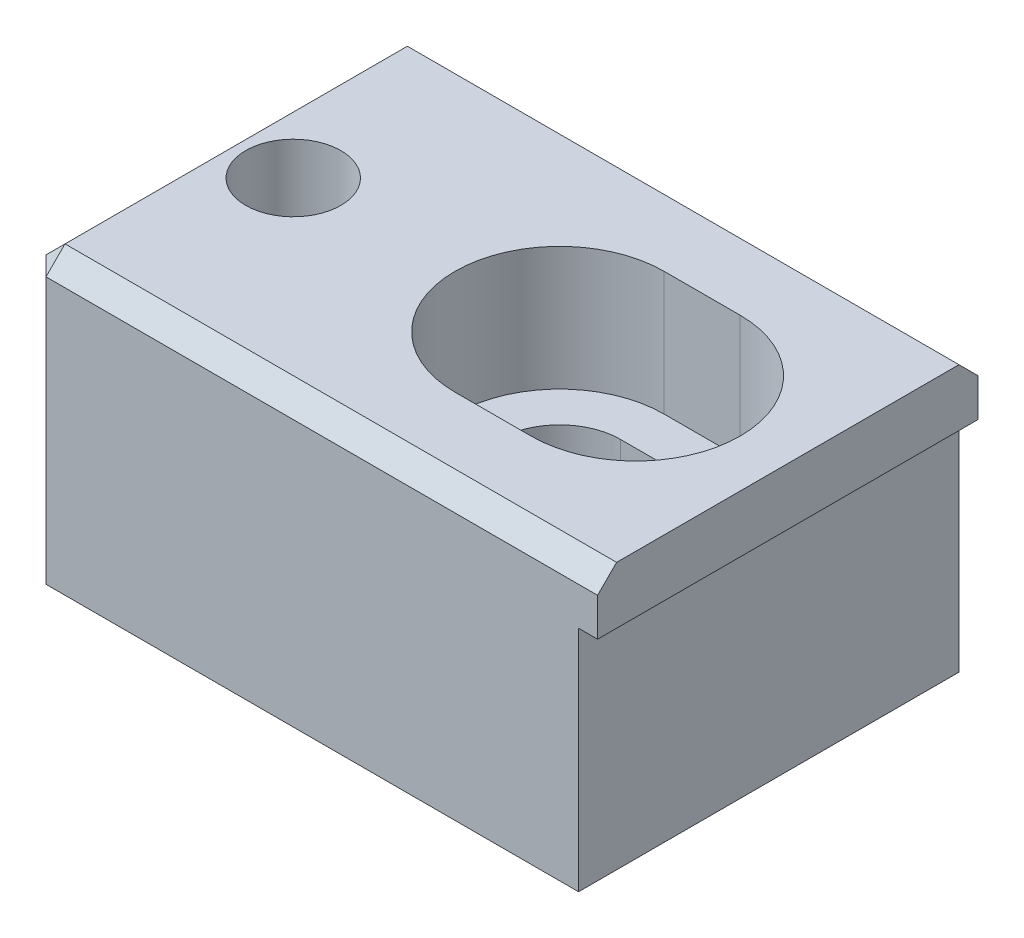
from build123d import *

# Parameters (mm, degrees)
BOSS_EXTRU_1_DEPTH      = 10
CHANFREIN1_SIZE         = 1
TROU_TARAUD_M61_D       = 5
ENL_V_MAT_EXTRU_1_DEPTH = 6.5
ENL_V_MAT_EXTRU_2_DEPTH = 31.561577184


with BuildPart() as part:
    # Esquisse1 → Boss.-Extru.1 (new, symmetric)
    with BuildSketch(Plane.XY):
        Polygon((-27.6, 25), (2.4, 25), (2.4, 22), (1.4, 22), (1.4, 10), (-27.6, 10), align=None)
    extrude(amount=BOSS_EXTRU_1_DEPTH, both=True)

    # Chanfrein1
    chanfrein1_edges = [part.edges().sort_by_distance(p)[0] for p in [
        (-27.6, 25, 0),
        (-12.6, 25, 10),
        (-27.6, 17.5, 10),
        (-12.6, 25, -10),
        (-27.6, 17.5, -10),
    ]]
    chamfer(chanfrein1_edges, length=CHANFREIN1_SIZE)

    # Trou taraud_ M61 (through all)
    with Locations(Plane(origin=(0, 25, 0), x_dir=(1, 0, 0), z_dir=(0, 1, 0))):
        with Locations((-23.6, 0)):
            Hole(TROU_TARAUD_M61_D / 2)

    # Esquisse13 → Enl_v. mat.-Extru.1 (cut)
    with BuildSketch(Plane(origin=(0, 25, 0), x_dir=(1, 0, 0), z_dir=(0, 1, 0))):
        with BuildLine():
            Line((-9.6, 5.5), (-5.6, 5.5))
            ThreePointArc((-5.6, 5.5), (-0.1, 0), (-5.6, -5.5))
            Line((-5.6, -5.5), (-9.6, -5.5))
            ThreePointArc((-9.6, -5.5), (-15.1, 0), (-9.6, 5.5))
        make_face()
    extrude(amount=-ENL_V_MAT_EXTRU_1_DEPTH, mode=Mode.SUBTRACT)

    # Esquisse14 → Enl_v. mat.-Extru.2 (cut, through all)
    with BuildSketch(Plane(origin=(0, 18.5, 0), x_dir=(1, 0, 0), z_dir=(0, 1, 0))):
        with BuildLine():
            Line((-9.6, 3.2), (-5.6, 3.2))
            ThreePointArc((-5.6, 3.2), (-2.4, 0), (-5.6, -3.2))
            Line((-5.6, -3.2), (-9.6, -3.2))
            ThreePointArc((-9.6, -3.2), (-12.8, 0), (-9.6, 3.2))
        make_face()
    extrude(amount=-ENL_V_MAT_EXTRU_2_DEPTH, mode=Mode.SUBTRACT)


solid = part.part
